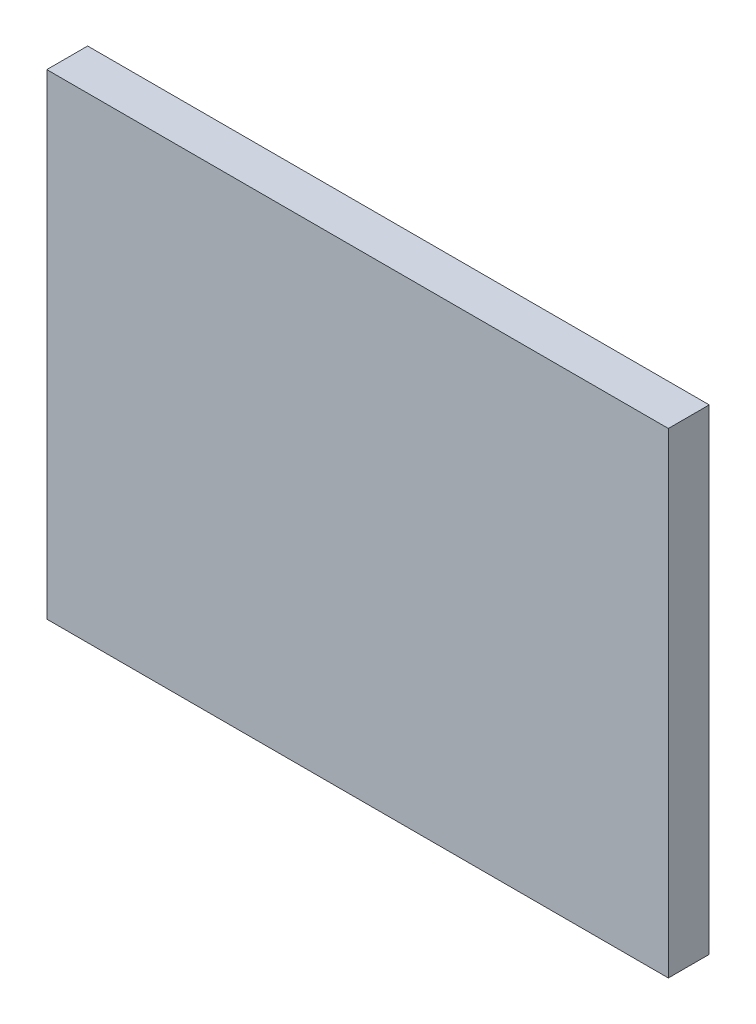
ISO-10303-21;
HEADER;
FILE_DESCRIPTION(('STEP AP214'),'2;1');
FILE_NAME('part.step','',(''),(''),'','','');
FILE_SCHEMA(('AUTOMOTIVE_DESIGN { 1 0 10303 214 1 1 1 1 }'));
ENDSEC;
DATA;
#1=APPLICATION_CONTEXT('core data for automotive mechanical design processes');
#2=APPLICATION_PROTOCOL_DEFINITION('international standard','automotive_design',2000,#1);
#3=PRODUCT_CONTEXT('',#1,'mechanical');
#4=PRODUCT('Part','Part','',(#3));
#5=PRODUCT_RELATED_PRODUCT_CATEGORY('part','',(#4));
#6=PRODUCT_DEFINITION_FORMATION('','',#4);
#7=PRODUCT_DEFINITION_CONTEXT('part definition',#1,'design');
#8=PRODUCT_DEFINITION('design','',#6,#7);
#9=PRODUCT_DEFINITION_SHAPE('','',#8);
#10=(LENGTH_UNIT() NAMED_UNIT(*) SI_UNIT(.MILLI.,.METRE.));
#11=(NAMED_UNIT(*) PLANE_ANGLE_UNIT() SI_UNIT($,.RADIAN.));
#12=(NAMED_UNIT(*) SI_UNIT($,.STERADIAN.) SOLID_ANGLE_UNIT());
#13=UNCERTAINTY_MEASURE_WITH_UNIT(LENGTH_MEASURE(1.E-05),#10,'distance_accuracy_value','');
#14=(GEOMETRIC_REPRESENTATION_CONTEXT(3) GLOBAL_UNCERTAINTY_ASSIGNED_CONTEXT((#13)) GLOBAL_UNIT_ASSIGNED_CONTEXT((#10,
#11,#12)) REPRESENTATION_CONTEXT('',''));
#15=CARTESIAN_POINT('',(0.,0.,0.));
#16=DIRECTION('',(0.,0.,1.));
#17=DIRECTION('',(1.,0.,0.));
#18=AXIS2_PLACEMENT_3D('',#15,#16,#17);
#19=CARTESIAN_POINT('',(-11.2173211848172,33.2678087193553,5.));
#20=DIRECTION('',(1.,0.,0.));
#21=DIRECTION('',(0.,0.,-1.));
#22=AXIS2_PLACEMENT_3D('',#19,#20,#21);
#23=PLANE('',#22);
#24=DIRECTION('',(0.,-1.,0.));
#25=VECTOR('',#24,1.);
#26=CARTESIAN_POINT('',(-11.2173211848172,33.2678087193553,0.));
#27=LINE('',#26,#25);
#28=CARTESIAN_POINT('',(-11.2173211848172,33.2678087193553,0.));
#29=VERTEX_POINT('',#28);
#30=CARTESIAN_POINT('',(-11.2173211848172,-24.9700642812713,0.));
#31=VERTEX_POINT('',#30);
#32=EDGE_CURVE('E98',#29,#31,#27,.T.);
#33=ORIENTED_EDGE('',*,*,#32,.T.);
#34=DIRECTION('',(0.,0.,-1.));
#35=VECTOR('',#34,1.);
#36=CARTESIAN_POINT('',(-11.2173211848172,-24.9700642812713,5.));
#37=LINE('',#36,#35);
#38=CARTESIAN_POINT('',(-11.2173211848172,-24.9700642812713,5.));
#39=VERTEX_POINT('',#38);
#40=EDGE_CURVE('E11',#39,#31,#37,.T.);
#41=ORIENTED_EDGE('',*,*,#40,.F.);
#42=DIRECTION('',(0.,-1.,0.));
#43=VECTOR('',#42,1.);
#44=CARTESIAN_POINT('',(-11.2173211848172,33.2678087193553,5.));
#45=LINE('',#44,#43);
#46=CARTESIAN_POINT('',(-11.2173211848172,33.2678087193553,5.));
#47=VERTEX_POINT('',#46);
#48=EDGE_CURVE('E86',#47,#39,#45,.T.);
#49=ORIENTED_EDGE('',*,*,#48,.F.);
#50=DIRECTION('',(0.,0.,-1.));
#51=VECTOR('',#50,1.);
#52=CARTESIAN_POINT('',(-11.2173211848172,33.2678087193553,5.));
#53=LINE('',#52,#51);
#54=EDGE_CURVE('E94',#47,#29,#53,.T.);
#55=ORIENTED_EDGE('',*,*,#54,.T.);
#56=EDGE_LOOP('',(#33,#41,#49,#55));
#57=FACE_BOUND('',#56,.T.);
#58=ADVANCED_FACE('F35',(#57),#23,.F.);
#59=CARTESIAN_POINT('',(-11.2173211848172,-24.9700642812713,5.));
#60=DIRECTION('',(0.,1.,0.));
#61=DIRECTION('',(0.,0.,1.));
#62=AXIS2_PLACEMENT_3D('',#59,#60,#61);
#63=PLANE('',#62);
#64=DIRECTION('',(1.,0.,0.));
#65=VECTOR('',#64,1.);
#66=CARTESIAN_POINT('',(-11.2173211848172,-24.9700642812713,0.));
#67=LINE('',#66,#65);
#68=CARTESIAN_POINT('',(64.8453361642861,-24.9700642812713,0.));
#69=VERTEX_POINT('',#68);
#70=EDGE_CURVE('E90',#31,#69,#67,.T.);
#71=ORIENTED_EDGE('',*,*,#70,.T.);
#72=DIRECTION('',(0.,0.,-1.));
#73=VECTOR('',#72,1.);
#74=CARTESIAN_POINT('',(64.8453361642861,-24.9700642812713,5.));
#75=LINE('',#74,#73);
#76=CARTESIAN_POINT('',(64.8453361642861,-24.9700642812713,5.));
#77=VERTEX_POINT('',#76);
#78=EDGE_CURVE('E43',#77,#69,#75,.T.);
#79=ORIENTED_EDGE('',*,*,#78,.F.);
#80=DIRECTION('',(1.,0.,0.));
#81=VECTOR('',#80,1.);
#82=CARTESIAN_POINT('',(-11.2173211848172,-24.9700642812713,5.));
#83=LINE('',#82,#81);
#84=EDGE_CURVE('E81',#39,#77,#83,.T.);
#85=ORIENTED_EDGE('',*,*,#84,.F.);
#86=ORIENTED_EDGE('',*,*,#40,.T.);
#87=EDGE_LOOP('',(#71,#79,#85,#86));
#88=FACE_BOUND('',#87,.T.);
#89=ADVANCED_FACE('F89',(#88),#63,.F.);
#90=CARTESIAN_POINT('',(64.8453361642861,33.2678087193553,5.));
#91=DIRECTION('',(-1.,0.,0.));
#92=DIRECTION('',(0.,0.,1.));
#93=AXIS2_PLACEMENT_3D('',#90,#91,#92);
#94=PLANE('',#93);
#95=DIRECTION('',(0.,1.,0.));
#96=VECTOR('',#95,1.);
#97=CARTESIAN_POINT('',(64.8453361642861,33.2678087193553,0.));
#98=LINE('',#97,#96);
#99=CARTESIAN_POINT('',(64.8453361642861,33.2678087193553,0.));
#100=VERTEX_POINT('',#99);
#101=EDGE_CURVE('E68',#69,#100,#98,.T.);
#102=ORIENTED_EDGE('',*,*,#101,.T.);
#103=DIRECTION('',(0.,0.,-1.));
#104=VECTOR('',#103,1.);
#105=CARTESIAN_POINT('',(64.8453361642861,33.2678087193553,5.));
#106=LINE('',#105,#104);
#107=CARTESIAN_POINT('',(64.8453361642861,33.2678087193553,5.));
#108=VERTEX_POINT('',#107);
#109=EDGE_CURVE('E91',#108,#100,#106,.T.);
#110=ORIENTED_EDGE('',*,*,#109,.F.);
#111=DIRECTION('',(0.,1.,0.));
#112=VECTOR('',#111,1.);
#113=CARTESIAN_POINT('',(64.8453361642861,33.2678087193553,5.));
#114=LINE('',#113,#112);
#115=EDGE_CURVE('E84',#77,#108,#114,.T.);
#116=ORIENTED_EDGE('',*,*,#115,.F.);
#117=ORIENTED_EDGE('',*,*,#78,.T.);
#118=EDGE_LOOP('',(#102,#110,#116,#117));
#119=FACE_BOUND('',#118,.T.);
#120=ADVANCED_FACE('F92',(#119),#94,.F.);
#121=CARTESIAN_POINT('',(-11.2173211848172,33.2678087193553,5.));
#122=DIRECTION('',(0.,-1.,0.));
#123=DIRECTION('',(0.,0.,-1.));
#124=AXIS2_PLACEMENT_3D('',#121,#122,#123);
#125=PLANE('',#124);
#126=DIRECTION('',(-1.,0.,0.));
#127=VECTOR('',#126,1.);
#128=CARTESIAN_POINT('',(-11.2173211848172,33.2678087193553,0.));
#129=LINE('',#128,#127);
#130=EDGE_CURVE('E74',#100,#29,#129,.T.);
#131=ORIENTED_EDGE('',*,*,#130,.T.);
#132=ORIENTED_EDGE('',*,*,#54,.F.);
#133=DIRECTION('',(-1.,0.,0.));
#134=VECTOR('',#133,1.);
#135=CARTESIAN_POINT('',(-11.2173211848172,33.2678087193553,5.));
#136=LINE('',#135,#134);
#137=EDGE_CURVE('E51',#108,#47,#136,.T.);
#138=ORIENTED_EDGE('',*,*,#137,.F.);
#139=ORIENTED_EDGE('',*,*,#109,.T.);
#140=EDGE_LOOP('',(#131,#132,#138,#139));
#141=FACE_BOUND('',#140,.T.);
#142=ADVANCED_FACE('F105',(#141),#125,.F.);
#143=CARTESIAN_POINT('',(0.,0.,5.));
#144=DIRECTION('',(0.,0.,1.));
#145=DIRECTION('',(1.,0.,0.));
#146=AXIS2_PLACEMENT_3D('',#143,#144,#145);
#147=PLANE('',#146);
#148=ORIENTED_EDGE('',*,*,#48,.T.);
#149=ORIENTED_EDGE('',*,*,#84,.T.);
#150=ORIENTED_EDGE('',*,*,#115,.T.);
#151=ORIENTED_EDGE('',*,*,#137,.T.);
#152=EDGE_LOOP('',(#148,#149,#150,#151));
#153=FACE_BOUND('',#152,.T.);
#154=ADVANCED_FACE('F82',(#153),#147,.T.);
#155=CARTESIAN_POINT('',(0.,0.,0.));
#156=DIRECTION('',(0.,0.,1.));
#157=DIRECTION('',(1.,0.,0.));
#158=AXIS2_PLACEMENT_3D('',#155,#156,#157);
#159=PLANE('',#158);
#160=ORIENTED_EDGE('',*,*,#32,.F.);
#161=ORIENTED_EDGE('',*,*,#130,.F.);
#162=ORIENTED_EDGE('',*,*,#101,.F.);
#163=ORIENTED_EDGE('',*,*,#70,.F.);
#164=EDGE_LOOP('',(#160,#161,#162,#163));
#165=FACE_BOUND('',#164,.T.);
#166=ADVANCED_FACE('F108',(#165),#159,.F.);
#167=CLOSED_SHELL('',(#58,#89,#120,#142,#154,#166));
#168=MANIFOLD_SOLID_BREP('B2',#167);
#169=ADVANCED_BREP_SHAPE_REPRESENTATION('',(#18,#168),#14);
#170=SHAPE_DEFINITION_REPRESENTATION(#9,#169);
ENDSEC;
END-ISO-10303-21;
